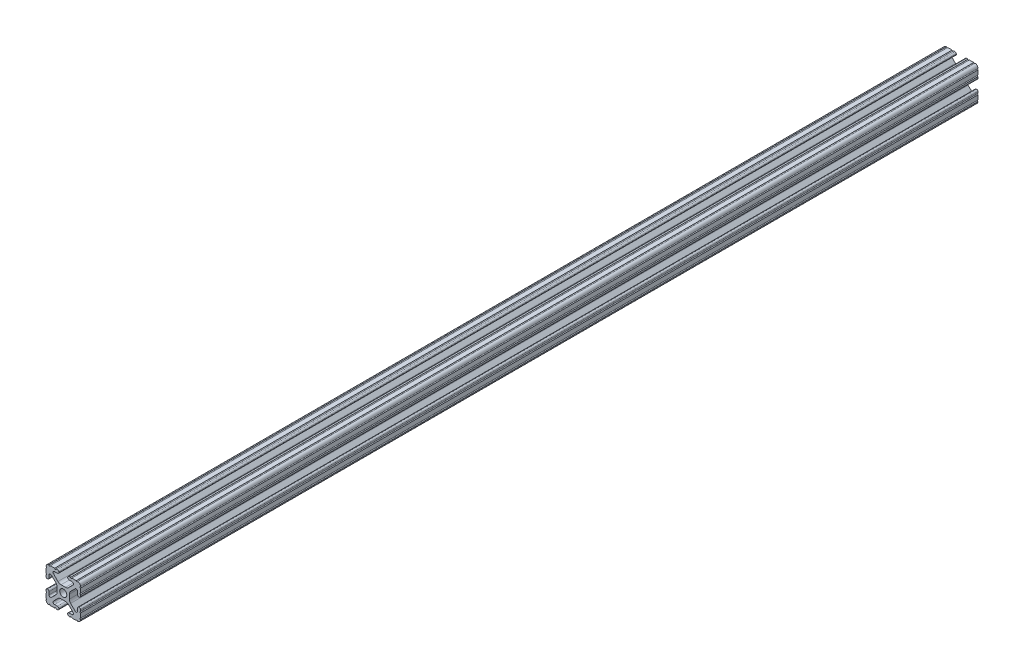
from build123d import *

# Parameters (mm, degrees)
SKETCH1_R      = 2.6035
EXTRUDE1_DEPTH = 660.4


with BuildPart() as part:
    # Sketch1 → Extrude1 (new body)
    with BuildSketch(Plane.XY):
        with BuildLine():
            Line((-7.207036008, 8.724370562), (-3.898272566, 5.423169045))
            ThreePointArc((-3.898272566, 5.423169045), (-2.869120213, 4.736787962), (-1.655778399, 4.4958))
            Line((-1.655778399, 4.4958), (1.655778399, 4.4958))
            ThreePointArc((1.655778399, 4.4958), (2.869120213, 4.736787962), (3.898272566, 5.423169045))
            Line((3.898272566, 5.423169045), (7.207036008, 8.724370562))
            ThreePointArc((7.207036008, 8.724370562), (7.432222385, 9.85140422), (6.476788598, 10.4902))
            Line((6.476788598, 10.4902), (4.287512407, 10.4902))
            ThreePointArc((4.287512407, 10.4902), (3.54574862, 10.79744862), (3.2385, 11.539212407))
            Line((3.2385, 11.539212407), (3.2385, 11.650987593))
            ThreePointArc((3.2385, 11.650987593), (3.54574862, 12.39275138), (4.287512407, 12.7))
            Line((4.287512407, 12.7), (5.317126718, 12.7))
            ThreePointArc((5.317126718, 12.7), (5.825126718, 12.192), (6.333126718, 12.7))
            Line((6.333126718, 12.7), (9.550443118, 12.7))
            ThreePointArc((9.550443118, 12.7), (10.058366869, 12.192000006), (10.566443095, 12.699847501))
            ThreePointArc((10.566443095, 12.699847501), (12.082537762, 12.08250727), (12.699846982, 10.566399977))
            ThreePointArc((12.699846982, 10.566399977), (12.192000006, 10.058323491), (12.7, 9.5504))
            Line((12.7, 9.5504), (12.7, 6.3330836))
            ThreePointArc((12.7, 6.3330836), (12.192, 5.8250836), (12.7, 5.3170836))
            Line((12.7, 5.3170836), (12.7, 4.287469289))
            ThreePointArc((12.7, 4.287469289), (12.39275138, 3.545705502), (11.650987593, 3.238456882))
            Line((11.650987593, 3.238456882), (11.539212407, 3.238456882))
            ThreePointArc((11.539212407, 3.238456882), (10.79744862, 3.545705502), (10.4902, 4.287469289))
            Line((10.4902, 4.287469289), (10.4902, 6.402089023))
            ThreePointArc((10.4902, 6.402089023), (9.856505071, 7.351067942), (8.737131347, 7.129408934))
            Line((8.737131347, 7.129408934), (5.441005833, 3.840816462))
            ThreePointArc((5.441005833, 3.840816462), (4.750877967, 2.809883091), (4.5085, 1.593185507))
            Line((4.5085, 1.593185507), (4.5085, -1.593185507))
            ThreePointArc((4.5085, -1.593185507), (4.750877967, -2.809883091), (5.441005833, -3.840816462))
            Line((5.441005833, -3.840816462), (8.737131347, -7.129408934))
            ThreePointArc((8.737131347, -7.129408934), (9.856505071, -7.351067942), (10.4902, -6.402089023))
            Line((10.4902, -6.402089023), (10.4902, -4.287469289))
            ThreePointArc((10.4902, -4.287469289), (10.79744862, -3.545705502), (11.539212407, -3.238456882))
            Line((11.539212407, -3.238456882), (11.650987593, -3.238456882))
            ThreePointArc((11.650987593, -3.238456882), (12.39275138, -3.545705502), (12.7, -4.287469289))
            Line((12.7, -4.287469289), (12.7, -5.3170836))
            ThreePointArc((12.7, -5.3170836), (12.192, -5.8250836), (12.7, -6.3330836))
            Line((12.7, -6.3330836), (12.7, -9.5504))
            ThreePointArc((12.7, -9.5504), (12.192000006, -10.058323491), (12.699846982, -10.566399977))
            ThreePointArc((12.699846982, -10.566399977), (12.082537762, -12.08250727), (10.566443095, -12.699847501))
            ThreePointArc((10.566443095, -12.699847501), (10.058366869, -12.192000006), (9.550443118, -12.7))
            Line((9.550443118, -12.7), (6.333126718, -12.7))
            ThreePointArc((6.333126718, -12.7), (5.825126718, -12.192), (5.317126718, -12.7))
            Line((5.317126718, -12.7), (4.287512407, -12.7))
            ThreePointArc((4.287512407, -12.7), (3.54574862, -12.39275138), (3.2385, -11.650987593))
            Line((3.2385, -11.650987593), (3.2385, -11.539212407))
            ThreePointArc((3.2385, -11.539212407), (3.54574862, -10.79744862), (4.287512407, -10.4902))
            Line((4.287512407, -10.4902), (6.416408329, -10.4902))
            ThreePointArc((6.416408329, -10.4902), (7.41473083, -9.822813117), (7.179650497, -8.645192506))
            Line((7.179650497, -8.645192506), (3.952270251, -5.423690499))
            ThreePointArc((3.952270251, -5.423690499), (2.922936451, -4.736929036), (1.709253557, -4.4958))
            Line((1.709253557, -4.4958), (-1.709253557, -4.4958))
            ThreePointArc((-1.709253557, -4.4958), (-2.922936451, -4.736929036), (-3.952270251, -5.423690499))
            Line((-3.952270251, -5.423690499), (-7.179650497, -8.645192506))
            ThreePointArc((-7.179650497, -8.645192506), (-7.41473083, -9.822813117), (-6.416408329, -10.4902))
            Line((-6.416408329, -10.4902), (-4.287512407, -10.4902))
            ThreePointArc((-4.287512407, -10.4902), (-3.54574862, -10.79744862), (-3.2385, -11.539212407))
            Line((-3.2385, -11.539212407), (-3.2385, -11.650987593))
            ThreePointArc((-3.2385, -11.650987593), (-3.54574862, -12.39275138), (-4.287512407, -12.7))
            Line((-4.287512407, -12.7), (-5.317126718, -12.7))
            ThreePointArc((-5.317126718, -12.7), (-5.825126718, -12.192), (-6.333126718, -12.7))
            Line((-6.333126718, -12.7), (-9.550443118, -12.7))
            ThreePointArc((-9.550443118, -12.7), (-10.058366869, -12.192000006), (-10.566443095, -12.699847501))
            ThreePointArc((-10.566443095, -12.699847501), (-12.082537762, -12.08250727), (-12.699846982, -10.566399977))
            ThreePointArc((-12.699846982, -10.566399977), (-12.192000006, -10.058323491), (-12.7, -9.5504))
            Line((-12.7, -9.5504), (-12.7, -6.3330836))
            ThreePointArc((-12.7, -6.3330836), (-12.192, -5.8250836), (-12.7, -5.3170836))
            Line((-12.7, -5.3170836), (-12.7, -4.287469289))
            ThreePointArc((-12.7, -4.287469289), (-12.39275138, -3.545705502), (-11.650987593, -3.238456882))
            Line((-11.650987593, -3.238456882), (-11.539212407, -3.238456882))
            ThreePointArc((-11.539212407, -3.238456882), (-10.79744862, -3.545705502), (-10.4902, -4.287469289))
            Line((-10.4902, -4.287469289), (-10.4902, -6.402089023))
            ThreePointArc((-10.4902, -6.402089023), (-9.856505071, -7.351067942), (-8.737131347, -7.129408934))
            Line((-8.737131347, -7.129408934), (-5.441005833, -3.840816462))
            ThreePointArc((-5.441005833, -3.840816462), (-4.750877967, -2.809883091), (-4.5085, -1.593185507))
            Line((-4.5085, -1.593185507), (-4.5085, 1.593185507))
            ThreePointArc((-4.5085, 1.593185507), (-4.750877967, 2.809883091), (-5.441005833, 3.840816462))
            Line((-5.441005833, 3.840816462), (-8.737131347, 7.129408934))
            ThreePointArc((-8.737131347, 7.129408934), (-9.856505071, 7.351067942), (-10.4902, 6.402089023))
            Line((-10.4902, 6.402089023), (-10.4902, 4.287469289))
            ThreePointArc((-10.4902, 4.287469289), (-10.79744862, 3.545705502), (-11.539212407, 3.238456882))
            Line((-11.539212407, 3.238456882), (-11.650987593, 3.238456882))
            ThreePointArc((-11.650987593, 3.238456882), (-12.39275138, 3.545705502), (-12.7, 4.287469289))
            Line((-12.7, 4.287469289), (-12.7, 5.3170836))
            ThreePointArc((-12.7, 5.3170836), (-12.192, 5.8250836), (-12.7, 6.3330836))
            Line((-12.7, 6.3330836), (-12.7, 9.5504))
            ThreePointArc((-12.7, 9.5504), (-12.192000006, 10.058323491), (-12.699846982, 10.566399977))
            ThreePointArc((-12.699846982, 10.566399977), (-12.082537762, 12.08250727), (-10.566443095, 12.699847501))
            ThreePointArc((-10.566443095, 12.699847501), (-10.058366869, 12.192000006), (-9.550443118, 12.7))
            Line((-9.550443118, 12.7), (-6.333126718, 12.7))
            ThreePointArc((-6.333126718, 12.7), (-5.825126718, 12.192), (-5.317126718, 12.7))
            Line((-5.317126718, 12.7), (-4.287512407, 12.7))
            ThreePointArc((-4.287512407, 12.7), (-3.54574862, 12.39275138), (-3.2385, 11.650987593))
            Line((-3.2385, 11.650987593), (-3.2385, 11.539212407))
            ThreePointArc((-3.2385, 11.539212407), (-3.54574862, 10.79744862), (-4.287512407, 10.4902))
            Line((-4.287512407, 10.4902), (-6.476788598, 10.4902))
            ThreePointArc((-6.476788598, 10.4902), (-7.432222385, 9.85140422), (-7.207036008, 8.724370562))
        make_face()
        Circle(SKETCH1_R, mode=Mode.SUBTRACT)
    extrude(amount=-EXTRUDE1_DEPTH)


solid = part.part
